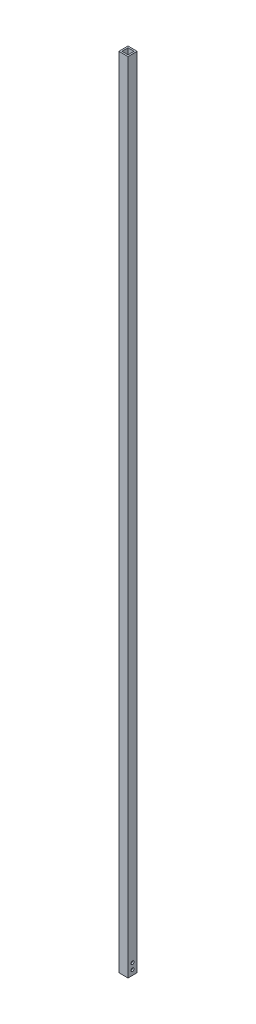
ISO-10303-21;
HEADER;
FILE_DESCRIPTION(('STEP AP214'),'2;1');
FILE_NAME('part.step','',(''),(''),'','','');
FILE_SCHEMA(('AUTOMOTIVE_DESIGN { 1 0 10303 214 1 1 1 1 }'));
ENDSEC;
DATA;
#1=APPLICATION_CONTEXT('core data for automotive mechanical design processes');
#2=APPLICATION_PROTOCOL_DEFINITION('international standard','automotive_design',2000,#1);
#3=PRODUCT_CONTEXT('',#1,'mechanical');
#4=PRODUCT('Part','Part','',(#3));
#5=PRODUCT_RELATED_PRODUCT_CATEGORY('part','',(#4));
#6=PRODUCT_DEFINITION_FORMATION('','',#4);
#7=PRODUCT_DEFINITION_CONTEXT('part definition',#1,'design');
#8=PRODUCT_DEFINITION('design','',#6,#7);
#9=PRODUCT_DEFINITION_SHAPE('','',#8);
#10=(LENGTH_UNIT() NAMED_UNIT(*) SI_UNIT(.MILLI.,.METRE.));
#11=(NAMED_UNIT(*) PLANE_ANGLE_UNIT() SI_UNIT($,.RADIAN.));
#12=(NAMED_UNIT(*) SI_UNIT($,.STERADIAN.) SOLID_ANGLE_UNIT());
#13=UNCERTAINTY_MEASURE_WITH_UNIT(LENGTH_MEASURE(1.E-05),#10,'distance_accuracy_value','');
#14=(GEOMETRIC_REPRESENTATION_CONTEXT(3) GLOBAL_UNCERTAINTY_ASSIGNED_CONTEXT((#13)) GLOBAL_UNIT_ASSIGNED_CONTEXT((#10,
#11,#12)) REPRESENTATION_CONTEXT('',''));
#15=CARTESIAN_POINT('',(0.,0.,0.));
#16=DIRECTION('',(0.,0.,1.));
#17=DIRECTION('',(1.,0.,0.));
#18=AXIS2_PLACEMENT_3D('',#15,#16,#17);
#19=CARTESIAN_POINT('',(0.,828.802,0.));
#20=DIRECTION('',(0.,-1.,0.));
#21=DIRECTION('',(0.,0.,-1.));
#22=AXIS2_PLACEMENT_3D('',#19,#20,#21);
#23=PLANE('',#22);
#24=DIRECTION('',(0.,0.,-1.));
#25=VECTOR('',#24,1.);
#26=CARTESIAN_POINT('',(4.7625,828.802,4.7625));
#27=LINE('',#26,#25);
#28=CARTESIAN_POINT('',(4.7625,828.802,4.7625));
#29=VERTEX_POINT('',#28);
#30=CARTESIAN_POINT('',(4.7625,828.802,-4.7625));
#31=VERTEX_POINT('',#30);
#32=EDGE_CURVE('E138',#29,#31,#27,.T.);
#33=ORIENTED_EDGE('',*,*,#32,.T.);
#34=DIRECTION('',(-1.,0.,0.));
#35=VECTOR('',#34,1.);
#36=CARTESIAN_POINT('',(-4.7625,828.802,-4.7625));
#37=LINE('',#36,#35);
#38=CARTESIAN_POINT('',(-4.7625,828.802,-4.7625));
#39=VERTEX_POINT('',#38);
#40=EDGE_CURVE('E141',#31,#39,#37,.T.);
#41=ORIENTED_EDGE('',*,*,#40,.T.);
#42=DIRECTION('',(0.,0.,1.));
#43=VECTOR('',#42,1.);
#44=CARTESIAN_POINT('',(-4.7625,828.802,4.7625));
#45=LINE('',#44,#43);
#46=CARTESIAN_POINT('',(-4.7625,828.802,4.7625));
#47=VERTEX_POINT('',#46);
#48=EDGE_CURVE('E144',#39,#47,#45,.T.);
#49=ORIENTED_EDGE('',*,*,#48,.T.);
#50=DIRECTION('',(1.,0.,0.));
#51=VECTOR('',#50,1.);
#52=CARTESIAN_POINT('',(-4.7625,828.802,4.7625));
#53=LINE('',#52,#51);
#54=EDGE_CURVE('E146',#47,#29,#53,.T.);
#55=ORIENTED_EDGE('',*,*,#54,.T.);
#56=EDGE_LOOP('',(#33,#41,#49,#55));
#57=FACE_BOUND('',#56,.T.);
#58=DIRECTION('',(1.,0.,0.));
#59=VECTOR('',#58,1.);
#60=CARTESIAN_POINT('',(-3.175,828.802,3.175));
#61=LINE('',#60,#59);
#62=CARTESIAN_POINT('',(-3.175,828.802,3.175));
#63=VERTEX_POINT('',#62);
#64=CARTESIAN_POINT('',(3.175,828.802,3.175));
#65=VERTEX_POINT('',#64);
#66=EDGE_CURVE('E100',#63,#65,#61,.T.);
#67=ORIENTED_EDGE('',*,*,#66,.F.);
#68=DIRECTION('',(0.,0.,1.));
#69=VECTOR('',#68,1.);
#70=CARTESIAN_POINT('',(-3.175,828.802,3.175));
#71=LINE('',#70,#69);
#72=CARTESIAN_POINT('',(-3.175,828.802,-3.175));
#73=VERTEX_POINT('',#72);
#74=EDGE_CURVE('E122',#73,#63,#71,.T.);
#75=ORIENTED_EDGE('',*,*,#74,.F.);
#76=DIRECTION('',(-1.,0.,0.));
#77=VECTOR('',#76,1.);
#78=CARTESIAN_POINT('',(-3.175,828.802,-3.175));
#79=LINE('',#78,#77);
#80=CARTESIAN_POINT('',(3.175,828.802,-3.175));
#81=VERTEX_POINT('',#80);
#82=EDGE_CURVE('E120',#81,#73,#79,.T.);
#83=ORIENTED_EDGE('',*,*,#82,.F.);
#84=DIRECTION('',(0.,0.,-1.));
#85=VECTOR('',#84,1.);
#86=CARTESIAN_POINT('',(3.175,828.802,3.175));
#87=LINE('',#86,#85);
#88=EDGE_CURVE('E108',#65,#81,#87,.T.);
#89=ORIENTED_EDGE('',*,*,#88,.F.);
#90=EDGE_LOOP('',(#67,#75,#83,#89));
#91=FACE_BOUND('',#90,.T.);
#92=ADVANCED_FACE('F33',(#57,#91),#23,.F.);
#93=CARTESIAN_POINT('',(0.,0.,0.));
#94=DIRECTION('',(0.,-1.,0.));
#95=DIRECTION('',(0.,0.,-1.));
#96=AXIS2_PLACEMENT_3D('',#93,#94,#95);
#97=PLANE('',#96);
#98=DIRECTION('',(0.,0.,-1.));
#99=VECTOR('',#98,1.);
#100=CARTESIAN_POINT('',(4.7625,0.,4.7625));
#101=LINE('',#100,#99);
#102=CARTESIAN_POINT('',(4.7625,0.,4.7625));
#103=VERTEX_POINT('',#102);
#104=CARTESIAN_POINT('',(4.7625,0.,-4.7625));
#105=VERTEX_POINT('',#104);
#106=EDGE_CURVE('E116',#103,#105,#101,.T.);
#107=ORIENTED_EDGE('',*,*,#106,.F.);
#108=DIRECTION('',(1.,0.,0.));
#109=VECTOR('',#108,1.);
#110=CARTESIAN_POINT('',(-4.7625,0.,4.7625));
#111=LINE('',#110,#109);
#112=CARTESIAN_POINT('',(-4.7625,0.,4.7625));
#113=VERTEX_POINT('',#112);
#114=EDGE_CURVE('E142',#113,#103,#111,.T.);
#115=ORIENTED_EDGE('',*,*,#114,.F.);
#116=DIRECTION('',(0.,0.,1.));
#117=VECTOR('',#116,1.);
#118=CARTESIAN_POINT('',(-4.7625,0.,4.7625));
#119=LINE('',#118,#117);
#120=CARTESIAN_POINT('',(-4.7625,0.,-4.7625));
#121=VERTEX_POINT('',#120);
#122=EDGE_CURVE('E153',#121,#113,#119,.T.);
#123=ORIENTED_EDGE('',*,*,#122,.F.);
#124=DIRECTION('',(-1.,0.,0.));
#125=VECTOR('',#124,1.);
#126=CARTESIAN_POINT('',(-4.7625,0.,-4.7625));
#127=LINE('',#126,#125);
#128=EDGE_CURVE('E151',#105,#121,#127,.T.);
#129=ORIENTED_EDGE('',*,*,#128,.F.);
#130=EDGE_LOOP('',(#107,#115,#123,#129));
#131=FACE_BOUND('',#130,.T.);
#132=DIRECTION('',(0.,0.,1.));
#133=VECTOR('',#132,1.);
#134=CARTESIAN_POINT('',(-3.175,0.,3.175));
#135=LINE('',#134,#133);
#136=CARTESIAN_POINT('',(-3.175,0.,-3.175));
#137=VERTEX_POINT('',#136);
#138=CARTESIAN_POINT('',(-3.175,0.,3.175));
#139=VERTEX_POINT('',#138);
#140=EDGE_CURVE('E109',#137,#139,#135,.T.);
#141=ORIENTED_EDGE('',*,*,#140,.T.);
#142=DIRECTION('',(1.,0.,0.));
#143=VECTOR('',#142,1.);
#144=CARTESIAN_POINT('',(-3.175,0.,3.175));
#145=LINE('',#144,#143);
#146=CARTESIAN_POINT('',(3.175,0.,3.175));
#147=VERTEX_POINT('',#146);
#148=EDGE_CURVE('E58',#139,#147,#145,.T.);
#149=ORIENTED_EDGE('',*,*,#148,.T.);
#150=DIRECTION('',(0.,0.,-1.));
#151=VECTOR('',#150,1.);
#152=CARTESIAN_POINT('',(3.175,0.,3.175));
#153=LINE('',#152,#151);
#154=CARTESIAN_POINT('',(3.175,0.,-3.175));
#155=VERTEX_POINT('',#154);
#156=EDGE_CURVE('E115',#147,#155,#153,.T.);
#157=ORIENTED_EDGE('',*,*,#156,.T.);
#158=DIRECTION('',(-1.,0.,0.));
#159=VECTOR('',#158,1.);
#160=CARTESIAN_POINT('',(-3.175,0.,-3.175));
#161=LINE('',#160,#159);
#162=EDGE_CURVE('E130',#155,#137,#161,.T.);
#163=ORIENTED_EDGE('',*,*,#162,.T.);
#164=EDGE_LOOP('',(#141,#149,#157,#163));
#165=FACE_BOUND('',#164,.T.);
#166=ADVANCED_FACE('F206',(#131,#165),#97,.T.);
#167=CARTESIAN_POINT('',(4.7625,828.802,4.7625));
#168=DIRECTION('',(-1.,0.,0.));
#169=DIRECTION('',(0.,0.,1.));
#170=AXIS2_PLACEMENT_3D('',#167,#168,#169);
#171=PLANE('',#170);
#172=CARTESIAN_POINT('',(4.7625,5.08,8.48231628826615E-13));
#173=DIRECTION('',(-1.,0.,0.));
#174=DIRECTION('',(0.,0.,1.));
#175=AXIS2_PLACEMENT_3D('',#172,#173,#174);
#176=CIRCLE('',#175,1.5875);
#177=CARTESIAN_POINT('',(4.7625,5.08,1.58750000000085));
#178=VERTEX_POINT('',#177);
#179=EDGE_CURVE('E179',#178,#178,#176,.T.);
#180=ORIENTED_EDGE('',*,*,#179,.T.);
#181=EDGE_LOOP('',(#180));
#182=FACE_BOUND('',#181,.T.);
#183=CARTESIAN_POINT('',(4.7625,11.43,8.4781162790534E-13));
#184=DIRECTION('',(-1.,0.,0.));
#185=DIRECTION('',(0.,0.,1.));
#186=AXIS2_PLACEMENT_3D('',#183,#184,#185);
#187=CIRCLE('',#186,1.5875);
#188=CARTESIAN_POINT('',(4.7625,11.43,1.58750000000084));
#189=VERTEX_POINT('',#188);
#190=EDGE_CURVE('E164',#189,#189,#187,.T.);
#191=ORIENTED_EDGE('',*,*,#190,.T.);
#192=EDGE_LOOP('',(#191));
#193=FACE_BOUND('',#192,.T.);
#194=ORIENTED_EDGE('',*,*,#106,.T.);
#195=DIRECTION('',(0.,-1.,0.));
#196=VECTOR('',#195,1.);
#197=CARTESIAN_POINT('',(4.7625,828.802,-4.7625));
#198=LINE('',#197,#196);
#199=EDGE_CURVE('E11',#31,#105,#198,.T.);
#200=ORIENTED_EDGE('',*,*,#199,.F.);
#201=ORIENTED_EDGE('',*,*,#32,.F.);
#202=DIRECTION('',(0.,-1.,0.));
#203=VECTOR('',#202,1.);
#204=CARTESIAN_POINT('',(4.7625,828.802,4.7625));
#205=LINE('',#204,#203);
#206=EDGE_CURVE('E148',#29,#103,#205,.T.);
#207=ORIENTED_EDGE('',*,*,#206,.T.);
#208=EDGE_LOOP('',(#194,#200,#201,#207));
#209=FACE_BOUND('',#208,.T.);
#210=ADVANCED_FACE('F35',(#182,#193,#209),#171,.F.);
#211=CARTESIAN_POINT('',(-4.7625,828.802,-4.7625));
#212=DIRECTION('',(0.,0.,1.));
#213=DIRECTION('',(1.,0.,0.));
#214=AXIS2_PLACEMENT_3D('',#211,#212,#213);
#215=PLANE('',#214);
#216=ORIENTED_EDGE('',*,*,#128,.T.);
#217=DIRECTION('',(0.,-1.,0.));
#218=VECTOR('',#217,1.);
#219=CARTESIAN_POINT('',(-4.7625,828.802,-4.7625));
#220=LINE('',#219,#218);
#221=EDGE_CURVE('E42',#39,#121,#220,.T.);
#222=ORIENTED_EDGE('',*,*,#221,.F.);
#223=ORIENTED_EDGE('',*,*,#40,.F.);
#224=ORIENTED_EDGE('',*,*,#199,.T.);
#225=EDGE_LOOP('',(#216,#222,#223,#224));
#226=FACE_BOUND('',#225,.T.);
#227=ADVANCED_FACE('F192',(#226),#215,.F.);
#228=CARTESIAN_POINT('',(-4.7625,828.802,4.7625));
#229=DIRECTION('',(1.,0.,0.));
#230=DIRECTION('',(0.,0.,-1.));
#231=AXIS2_PLACEMENT_3D('',#228,#229,#230);
#232=PLANE('',#231);
#233=CARTESIAN_POINT('',(-4.7625,5.08,8.48231628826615E-13));
#234=DIRECTION('',(-1.,0.,0.));
#235=DIRECTION('',(0.,0.,1.));
#236=AXIS2_PLACEMENT_3D('',#233,#234,#235);
#237=CIRCLE('',#236,1.58749999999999);
#238=CARTESIAN_POINT('',(-4.7625,5.08,1.58750000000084));
#239=VERTEX_POINT('',#238);
#240=EDGE_CURVE('E182',#239,#239,#237,.T.);
#241=ORIENTED_EDGE('',*,*,#240,.F.);
#242=EDGE_LOOP('',(#241));
#243=FACE_BOUND('',#242,.T.);
#244=CARTESIAN_POINT('',(-4.7625,11.43,8.4781162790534E-13));
#245=DIRECTION('',(-1.,0.,0.));
#246=DIRECTION('',(0.,0.,1.));
#247=AXIS2_PLACEMENT_3D('',#244,#245,#246);
#248=CIRCLE('',#247,1.58749999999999);
#249=CARTESIAN_POINT('',(-4.7625,11.43,1.58750000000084));
#250=VERTEX_POINT('',#249);
#251=EDGE_CURVE('E169',#250,#250,#248,.T.);
#252=ORIENTED_EDGE('',*,*,#251,.F.);
#253=EDGE_LOOP('',(#252));
#254=FACE_BOUND('',#253,.T.);
#255=ORIENTED_EDGE('',*,*,#122,.T.);
#256=DIRECTION('',(0.,-1.,0.));
#257=VECTOR('',#256,1.);
#258=CARTESIAN_POINT('',(-4.7625,828.802,4.7625));
#259=LINE('',#258,#257);
#260=EDGE_CURVE('E158',#47,#113,#259,.T.);
#261=ORIENTED_EDGE('',*,*,#260,.F.);
#262=ORIENTED_EDGE('',*,*,#48,.F.);
#263=ORIENTED_EDGE('',*,*,#221,.T.);
#264=EDGE_LOOP('',(#255,#261,#262,#263));
#265=FACE_BOUND('',#264,.T.);
#266=ADVANCED_FACE('F188',(#243,#254,#265),#232,.F.);
#267=CARTESIAN_POINT('',(-4.7625,828.802,4.7625));
#268=DIRECTION('',(0.,0.,-1.));
#269=DIRECTION('',(-1.,0.,0.));
#270=AXIS2_PLACEMENT_3D('',#267,#268,#269);
#271=PLANE('',#270);
#272=ORIENTED_EDGE('',*,*,#114,.T.);
#273=ORIENTED_EDGE('',*,*,#206,.F.);
#274=ORIENTED_EDGE('',*,*,#54,.F.);
#275=ORIENTED_EDGE('',*,*,#260,.T.);
#276=EDGE_LOOP('',(#272,#273,#274,#275));
#277=FACE_BOUND('',#276,.T.);
#278=ADVANCED_FACE('F191',(#277),#271,.F.);
#279=CARTESIAN_POINT('',(-3.175,828.802,3.175));
#280=DIRECTION('',(0.,0.,-1.));
#281=DIRECTION('',(-1.,0.,0.));
#282=AXIS2_PLACEMENT_3D('',#279,#280,#281);
#283=PLANE('',#282);
#284=ORIENTED_EDGE('',*,*,#148,.F.);
#285=DIRECTION('',(0.,-1.,0.));
#286=VECTOR('',#285,1.);
#287=CARTESIAN_POINT('',(-3.175,828.802,3.175));
#288=LINE('',#287,#286);
#289=EDGE_CURVE('E104',#63,#139,#288,.T.);
#290=ORIENTED_EDGE('',*,*,#289,.F.);
#291=ORIENTED_EDGE('',*,*,#66,.T.);
#292=DIRECTION('',(0.,-1.,0.));
#293=VECTOR('',#292,1.);
#294=CARTESIAN_POINT('',(3.175,828.802,3.175));
#295=LINE('',#294,#293);
#296=EDGE_CURVE('E103',#65,#147,#295,.T.);
#297=ORIENTED_EDGE('',*,*,#296,.T.);
#298=EDGE_LOOP('',(#284,#290,#291,#297));
#299=FACE_BOUND('',#298,.T.);
#300=ADVANCED_FACE('F102',(#299),#283,.T.);
#301=CARTESIAN_POINT('',(3.175,828.802,3.175));
#302=DIRECTION('',(-1.,0.,0.));
#303=DIRECTION('',(0.,0.,1.));
#304=AXIS2_PLACEMENT_3D('',#301,#302,#303);
#305=PLANE('',#304);
#306=CARTESIAN_POINT('',(3.175,5.08,8.48231628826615E-13));
#307=DIRECTION('',(-1.,0.,0.));
#308=DIRECTION('',(0.,0.,1.));
#309=AXIS2_PLACEMENT_3D('',#306,#307,#308);
#310=CIRCLE('',#309,1.58749999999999);
#311=CARTESIAN_POINT('',(3.175,5.08,1.58750000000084));
#312=VERTEX_POINT('',#311);
#313=EDGE_CURVE('E174',#312,#312,#310,.T.);
#314=ORIENTED_EDGE('',*,*,#313,.F.);
#315=EDGE_LOOP('',(#314));
#316=FACE_BOUND('',#315,.T.);
#317=CARTESIAN_POINT('',(3.175,11.43,8.4781162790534E-13));
#318=DIRECTION('',(-1.,0.,0.));
#319=DIRECTION('',(0.,0.,1.));
#320=AXIS2_PLACEMENT_3D('',#317,#318,#319);
#321=CIRCLE('',#320,1.58749999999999);
#322=CARTESIAN_POINT('',(3.175,11.43,1.58750000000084));
#323=VERTEX_POINT('',#322);
#324=EDGE_CURVE('E128',#323,#323,#321,.T.);
#325=ORIENTED_EDGE('',*,*,#324,.F.);
#326=EDGE_LOOP('',(#325));
#327=FACE_BOUND('',#326,.T.);
#328=ORIENTED_EDGE('',*,*,#156,.F.);
#329=ORIENTED_EDGE('',*,*,#296,.F.);
#330=ORIENTED_EDGE('',*,*,#88,.T.);
#331=DIRECTION('',(0.,-1.,0.));
#332=VECTOR('',#331,1.);
#333=CARTESIAN_POINT('',(3.175,828.802,-3.175));
#334=LINE('',#333,#332);
#335=EDGE_CURVE('E117',#81,#155,#334,.T.);
#336=ORIENTED_EDGE('',*,*,#335,.T.);
#337=EDGE_LOOP('',(#328,#329,#330,#336));
#338=FACE_BOUND('',#337,.T.);
#339=ADVANCED_FACE('F112',(#316,#327,#338),#305,.T.);
#340=CARTESIAN_POINT('',(-3.175,828.802,-3.175));
#341=DIRECTION('',(0.,0.,1.));
#342=DIRECTION('',(1.,0.,0.));
#343=AXIS2_PLACEMENT_3D('',#340,#341,#342);
#344=PLANE('',#343);
#345=ORIENTED_EDGE('',*,*,#162,.F.);
#346=ORIENTED_EDGE('',*,*,#335,.F.);
#347=ORIENTED_EDGE('',*,*,#82,.T.);
#348=DIRECTION('',(0.,-1.,0.));
#349=VECTOR('',#348,1.);
#350=CARTESIAN_POINT('',(-3.175,828.802,-3.175));
#351=LINE('',#350,#349);
#352=EDGE_CURVE('E50',#73,#137,#351,.T.);
#353=ORIENTED_EDGE('',*,*,#352,.T.);
#354=EDGE_LOOP('',(#345,#346,#347,#353));
#355=FACE_BOUND('',#354,.T.);
#356=ADVANCED_FACE('F234',(#355),#344,.T.);
#357=CARTESIAN_POINT('',(-3.175,828.802,3.175));
#358=DIRECTION('',(1.,0.,0.));
#359=DIRECTION('',(0.,0.,-1.));
#360=AXIS2_PLACEMENT_3D('',#357,#358,#359);
#361=PLANE('',#360);
#362=CARTESIAN_POINT('',(-3.175,5.08,8.48231628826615E-13));
#363=DIRECTION('',(1.,0.,0.));
#364=DIRECTION('',(0.,0.,-1.));
#365=AXIS2_PLACEMENT_3D('',#362,#363,#364);
#366=CIRCLE('',#365,1.58749999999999);
#367=CARTESIAN_POINT('',(-3.175,5.08,-1.58749999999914));
#368=VERTEX_POINT('',#367);
#369=EDGE_CURVE('E37',#368,#368,#366,.T.);
#370=ORIENTED_EDGE('',*,*,#369,.F.);
#371=EDGE_LOOP('',(#370));
#372=FACE_BOUND('',#371,.T.);
#373=CARTESIAN_POINT('',(-3.175,11.43,8.4781162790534E-13));
#374=DIRECTION('',(1.,0.,0.));
#375=DIRECTION('',(0.,0.,-1.));
#376=AXIS2_PLACEMENT_3D('',#373,#374,#375);
#377=CIRCLE('',#376,1.58749999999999);
#378=CARTESIAN_POINT('',(-3.175,11.43,-1.58749999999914));
#379=VERTEX_POINT('',#378);
#380=EDGE_CURVE('E162',#379,#379,#377,.T.);
#381=ORIENTED_EDGE('',*,*,#380,.F.);
#382=EDGE_LOOP('',(#381));
#383=FACE_BOUND('',#382,.T.);
#384=ORIENTED_EDGE('',*,*,#140,.F.);
#385=ORIENTED_EDGE('',*,*,#352,.F.);
#386=ORIENTED_EDGE('',*,*,#74,.T.);
#387=ORIENTED_EDGE('',*,*,#289,.T.);
#388=EDGE_LOOP('',(#384,#385,#386,#387));
#389=FACE_BOUND('',#388,.T.);
#390=ADVANCED_FACE('F239',(#372,#383,#389),#361,.T.);
#391=CARTESIAN_POINT('',(-4.7625,11.43,8.4781162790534E-13));
#392=DIRECTION('',(-1.,0.,0.));
#393=DIRECTION('',(0.,0.,1.));
#394=AXIS2_PLACEMENT_3D('',#391,#392,#393);
#395=CYLINDRICAL_SURFACE('',#394,1.58749999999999);
#396=ORIENTED_EDGE('',*,*,#380,.T.);
#397=EDGE_LOOP('',(#396));
#398=FACE_BOUND('',#397,.T.);
#399=ORIENTED_EDGE('',*,*,#251,.T.);
#400=EDGE_LOOP('',(#399));
#401=FACE_BOUND('',#400,.T.);
#402=ADVANCED_FACE('F247',(#398,#401),#395,.F.);
#403=ORIENTED_EDGE('',*,*,#324,.T.);
#404=EDGE_LOOP('',(#403));
#405=FACE_BOUND('',#404,.T.);
#406=ORIENTED_EDGE('',*,*,#190,.F.);
#407=EDGE_LOOP('',(#406));
#408=FACE_BOUND('',#407,.T.);
#409=ADVANCED_FACE('F251',(#405,#408),#395,.F.);
#410=CARTESIAN_POINT('',(-4.7625,5.08,8.48231628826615E-13));
#411=DIRECTION('',(-1.,0.,0.));
#412=DIRECTION('',(0.,0.,1.));
#413=AXIS2_PLACEMENT_3D('',#410,#411,#412);
#414=CYLINDRICAL_SURFACE('',#413,1.58749999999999);
#415=ORIENTED_EDGE('',*,*,#369,.T.);
#416=EDGE_LOOP('',(#415));
#417=FACE_BOUND('',#416,.T.);
#418=ORIENTED_EDGE('',*,*,#240,.T.);
#419=EDGE_LOOP('',(#418));
#420=FACE_BOUND('',#419,.T.);
#421=ADVANCED_FACE('F186',(#417,#420),#414,.F.);
#422=ORIENTED_EDGE('',*,*,#313,.T.);
#423=EDGE_LOOP('',(#422));
#424=FACE_BOUND('',#423,.T.);
#425=ORIENTED_EDGE('',*,*,#179,.F.);
#426=EDGE_LOOP('',(#425));
#427=FACE_BOUND('',#426,.T.);
#428=ADVANCED_FACE('F253',(#424,#427),#414,.F.);
#429=CLOSED_SHELL('',(#92,#166,#210,#227,#266,#278,#300,#339,#356,#390,#402,#409,#421,#428));
#430=MANIFOLD_SOLID_BREP('B2',#429);
#431=ADVANCED_BREP_SHAPE_REPRESENTATION('',(#18,#430),#14);
#432=SHAPE_DEFINITION_REPRESENTATION(#9,#431);
ENDSEC;
END-ISO-10303-21;
